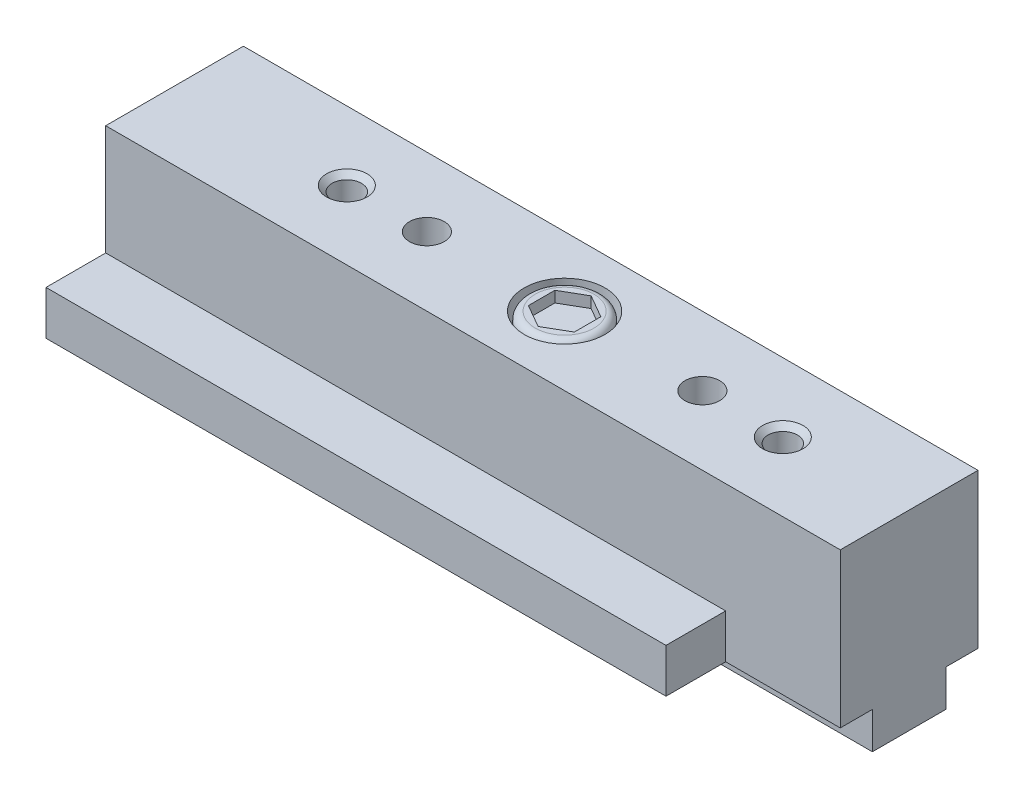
from build123d import *

# Parameters (mm, degrees)
EXTRUDE1_DEPTH     = 42.8752
EXTRUDE2_DEPTH     = 7.9248
SKETCH5_R          = 1.20269
CUT_EXTRUDE1_DEPTH = 3.048
SKETCH6_R          = 1.20269
CUT_EXTRUDE2_DEPTH = 3.048
SKETCH7_R          = 2.794
CUT_EXTRUDE3_DEPTH = 1.524
CUT_EXTRUDE4_DEPTH = 0.762


with BuildPart() as part:
    # Sketch1 → Extrude1 (new body)
    with BuildSketch(Plane(origin=(0, 0, 0), x_dir=(0, 0, -1), z_dir=(1, 0, 0))):
        Polygon((-8.89, 2.54), (-2.54, 2.54), (-2.54, 0), (2.54, 0), (2.54, 2.54), (8.89, 2.54), (8.89, 5.588), (4.7625, 5.588), (4.7625, 13.208), (-4.7625, 13.208), (-4.7625, 5.588), (-8.89, 5.588), align=None)
    extrude(amount=EXTRUDE1_DEPTH)

    # Sketch2 → Extrude2 (add)
    with BuildSketch(Plane(origin=(42.8752, 0, 0), x_dir=(0, 0, -1), z_dir=(1, 0, 0))):
        Polygon((-4.7625, 2.54), (-2.54, 2.54), (-2.54, 0), (2.54, 0), (2.54, 2.54), (4.7625, 2.54), (4.7625, 13.208), (-4.7625, 13.208), align=None)
    extrude(amount=EXTRUDE2_DEPTH)

    # Sketch3 → Cut-Revolve1 (revolve, cut)
    with BuildSketch(Plane(origin=(42.0624, 0, 0), x_dir=(0, 0, -1), z_dir=(1, 0, 0)), mode=Mode.PRIVATE) as cut_revolve1_sk:
        Polygon((0, 13.208), (1.397, 13.208), (1.016, 12.827), (1.016, 5.539587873), (0, 4.953), align=None)
    revolve(cut_revolve1_sk.sketch.rotate(Axis((42.0624, 4.953, 0), (0, 1, 0)), 180), axis=Axis((42.0624, 4.953, 0), (0, 1, 0)), mode=Mode.SUBTRACT)

    # Sketch4 → Cut-Revolve2 (revolve, cut)
    with BuildSketch(Plane(origin=(11.9126, 0, 0), x_dir=(0, 0, -1), z_dir=(1, 0, 0)), mode=Mode.PRIVATE) as cut_revolve2_sk:
        Polygon((0, 13.208), (1.397, 13.208), (1.016, 12.827), (1.016, 5.539587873), (0, 4.953), align=None)
    revolve(cut_revolve2_sk.sketch.rotate(Axis((11.9126, 4.953, 0), (0, 1, 0)), 180), axis=Axis((11.9126, 4.953, 0), (0, 1, 0)), mode=Mode.SUBTRACT)

    # Sketch5 → Cut-Extrude1 (cut)
    with BuildSketch(Plane(origin=(0, 13.208, 0), x_dir=(-1, 0, 0), z_dir=(0, 1, 0))):
        with Locations(Location((-36.4998, 0, 0), (0, 0, 90))):
            Circle(SKETCH5_R)
    extrude(amount=-CUT_EXTRUDE1_DEPTH, mode=Mode.SUBTRACT)

    # Sketch6 → Cut-Extrude2 (cut)
    with BuildSketch(Plane(origin=(0, 13.208, 0), x_dir=(-1, 0, 0), z_dir=(0, 1, 0))):
        with Locations(Location((-17.4498, 0, 0), (0, 0, 90))):
            Circle(SKETCH6_R)
    extrude(amount=-CUT_EXTRUDE2_DEPTH, mode=Mode.SUBTRACT)

    # Sketch7 → Cut-Extrude3 (cut)
    with BuildSketch(Plane(origin=(0, 13.208, 0), x_dir=(-1, 0, 0), z_dir=(0, 1, 0))):
        with Locations(Location((-26.9748, 0, 0), (0, 0, 90))):
            Circle(SKETCH7_R)
    extrude(amount=-CUT_EXTRUDE3_DEPTH, mode=Mode.SUBTRACT)

    # Sketch8 → Revolve1 (revolve)
    with BuildSketch(Plane(origin=(26.9748, 0, 0), x_dir=(0, 0, -1), z_dir=(1, 0, 0)), mode=Mode.PRIVATE) as revolve1_sk:
        with BuildLine():
            Line((0, 13.208), (2.032, 13.208))
            ThreePointArc((2.032, 13.208), (2.391210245, 13.059210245), (2.54, 12.7))
            Line((2.54, 12.7), (2.54, 11.684))
            Line((2.54, 11.684), (0, 11.684))
            Line((0, 11.684), (0, 13.208))
        make_face()
    revolve(revolve1_sk.sketch.rotate(Axis((26.9748, 11.684, 0), (0, 1, 0)), 180), axis=Axis((26.9748, 11.684, 0), (0, 1, 0)))

    # Sketch9 → Cut-Extrude4 (cut)
    with BuildSketch(Plane(origin=(0, 13.208, 0), x_dir=(-1, 0, 0), z_dir=(0, 1, 0))):
        Polygon((-25.3873, -0.916543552), (-25.3873, 0.916543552), (-26.9748, 1.833087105), (-28.5623, 0.916543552), (-28.5623, -0.916543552), (-26.9748, -1.833087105), align=None)
    extrude(amount=-CUT_EXTRUDE4_DEPTH, mode=Mode.SUBTRACT)


solid = part.part
